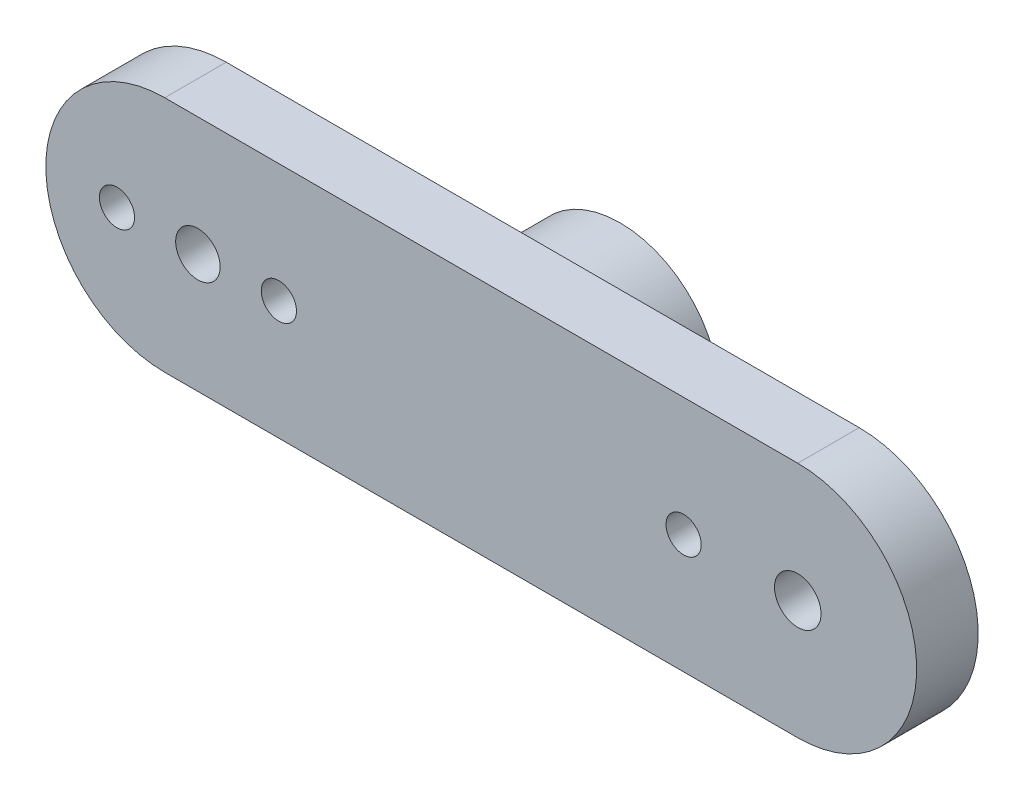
ISO-10303-21;
HEADER;
FILE_DESCRIPTION(('STEP AP214'),'2;1');
FILE_NAME('part.step','',(''),(''),'','','');
FILE_SCHEMA(('AUTOMOTIVE_DESIGN { 1 0 10303 214 1 1 1 1 }'));
ENDSEC;
DATA;
#1=APPLICATION_CONTEXT('core data for automotive mechanical design processes');
#2=APPLICATION_PROTOCOL_DEFINITION('international standard','automotive_design',2000,#1);
#3=PRODUCT_CONTEXT('',#1,'mechanical');
#4=PRODUCT('Part','Part','',(#3));
#5=PRODUCT_RELATED_PRODUCT_CATEGORY('part','',(#4));
#6=PRODUCT_DEFINITION_FORMATION('','',#4);
#7=PRODUCT_DEFINITION_CONTEXT('part definition',#1,'design');
#8=PRODUCT_DEFINITION('design','',#6,#7);
#9=PRODUCT_DEFINITION_SHAPE('','',#8);
#10=(LENGTH_UNIT() NAMED_UNIT(*) SI_UNIT(.MILLI.,.METRE.));
#11=(NAMED_UNIT(*) PLANE_ANGLE_UNIT() SI_UNIT($,.RADIAN.));
#12=(NAMED_UNIT(*) SI_UNIT($,.STERADIAN.) SOLID_ANGLE_UNIT());
#13=UNCERTAINTY_MEASURE_WITH_UNIT(LENGTH_MEASURE(1.E-05),#10,'distance_accuracy_value','');
#14=(GEOMETRIC_REPRESENTATION_CONTEXT(3) GLOBAL_UNCERTAINTY_ASSIGNED_CONTEXT((#13)) GLOBAL_UNIT_ASSIGNED_CONTEXT((#10,
#11,#12)) REPRESENTATION_CONTEXT('',''));
#15=CARTESIAN_POINT('',(0.,0.,0.));
#16=DIRECTION('',(0.,0.,1.));
#17=DIRECTION('',(1.,0.,0.));
#18=AXIS2_PLACEMENT_3D('',#15,#16,#17);
#19=CARTESIAN_POINT('',(14.9421564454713,11.0283619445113,17.7217193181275));
#20=DIRECTION('',(0.,0.,-1.));
#21=DIRECTION('',(-1.,0.,0.));
#22=AXIS2_PLACEMENT_3D('',#19,#20,#21);
#23=CYLINDRICAL_SURFACE('',#22,4.915);
#24=CARTESIAN_POINT('',(14.9421564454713,11.0283619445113,0.));
#25=DIRECTION('',(0.,0.,1.));
#26=DIRECTION('',(1.,0.,0.));
#27=AXIS2_PLACEMENT_3D('',#24,#25,#26);
#28=CIRCLE('',#27,4.915);
#29=CARTESIAN_POINT('',(19.8571564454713,11.0283619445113,0.));
#30=VERTEX_POINT('',#29);
#31=EDGE_CURVE('E35',#30,#30,#28,.T.);
#32=ORIENTED_EDGE('',*,*,#31,.T.);
#33=EDGE_LOOP('',(#32));
#34=FACE_BOUND('',#33,.T.);
#35=CARTESIAN_POINT('',(14.9421564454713,11.0283619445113,3.82));
#36=DIRECTION('',(0.,0.,1.));
#37=DIRECTION('',(1.,0.,0.));
#38=AXIS2_PLACEMENT_3D('',#35,#36,#37);
#39=CIRCLE('',#38,4.915);
#40=CARTESIAN_POINT('',(19.8571564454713,11.0283619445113,3.82));
#41=VERTEX_POINT('',#40);
#42=EDGE_CURVE('E11',#41,#41,#39,.T.);
#43=ORIENTED_EDGE('',*,*,#42,.F.);
#44=EDGE_LOOP('',(#43));
#45=FACE_BOUND('',#44,.T.);
#46=ADVANCED_FACE('F32',(#34,#45),#23,.T.);
#47=CARTESIAN_POINT('',(14.9421564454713,11.0283619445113,0.));
#48=DIRECTION('',(0.,0.,1.));
#49=DIRECTION('',(1.,0.,0.));
#50=AXIS2_PLACEMENT_3D('',#47,#48,#49);
#51=PLANE('',#50);
#52=ORIENTED_EDGE('',*,*,#31,.F.);
#53=EDGE_LOOP('',(#52));
#54=FACE_BOUND('',#53,.T.);
#55=CARTESIAN_POINT('',(14.9421564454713,11.0283619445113,0.));
#56=DIRECTION('',(0.,0.,1.));
#57=DIRECTION('',(1.,0.,0.));
#58=AXIS2_PLACEMENT_3D('',#55,#56,#57);
#59=CIRCLE('',#58,2.96);
#60=CARTESIAN_POINT('',(17.9021564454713,11.0283619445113,0.));
#61=VERTEX_POINT('',#60);
#62=EDGE_CURVE('E113',#61,#61,#59,.T.);
#63=ORIENTED_EDGE('',*,*,#62,.T.);
#64=EDGE_LOOP('',(#63));
#65=FACE_BOUND('',#64,.T.);
#66=ADVANCED_FACE('F122',(#54,#65),#51,.F.);
#67=CARTESIAN_POINT('',(14.9421564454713,11.0283619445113,17.7217193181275));
#68=DIRECTION('',(0.,0.,-1.));
#69=DIRECTION('',(-1.,0.,0.));
#70=AXIS2_PLACEMENT_3D('',#67,#68,#69);
#71=CYLINDRICAL_SURFACE('',#70,2.96);
#72=ORIENTED_EDGE('',*,*,#62,.F.);
#73=EDGE_LOOP('',(#72));
#74=FACE_BOUND('',#73,.T.);
#75=CARTESIAN_POINT('',(14.9421564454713,11.0283619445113,3.82));
#76=DIRECTION('',(0.,0.,1.));
#77=DIRECTION('',(1.,0.,0.));
#78=AXIS2_PLACEMENT_3D('',#75,#76,#77);
#79=CIRCLE('',#78,2.96);
#80=CARTESIAN_POINT('',(17.9021564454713,11.0283619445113,3.82));
#81=VERTEX_POINT('',#80);
#82=EDGE_CURVE('E111',#81,#81,#79,.T.);
#83=ORIENTED_EDGE('',*,*,#82,.T.);
#84=EDGE_LOOP('',(#83));
#85=FACE_BOUND('',#84,.T.);
#86=ADVANCED_FACE('F124',(#74,#85),#71,.F.);
#87=CARTESIAN_POINT('',(-0.697843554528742,11.0283619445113,3.82));
#88=DIRECTION('',(0.,0.,1.));
#89=DIRECTION('',(1.,0.,0.));
#90=AXIS2_PLACEMENT_3D('',#87,#88,#89);
#91=PLANE('',#90);
#92=ORIENTED_EDGE('',*,*,#82,.F.);
#93=EDGE_LOOP('',(#92));
#94=FACE_BOUND('',#93,.T.);
#95=ADVANCED_FACE('F129',(#94),#91,.F.);
#96=CARTESIAN_POINT('',(24.9421564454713,11.0283619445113,3.82));
#97=DIRECTION('',(0.,0.,1.));
#98=DIRECTION('',(-1.,0.,0.));
#99=AXIS2_PLACEMENT_3D('',#96,#97,#98);
#100=CIRCLE('',#99,0.870000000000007);
#101=CARTESIAN_POINT('',(24.0721564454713,11.0283619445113,3.82));
#102=VERTEX_POINT('',#101);
#103=EDGE_CURVE('E181',#102,#102,#100,.T.);
#104=ORIENTED_EDGE('',*,*,#103,.T.);
#105=EDGE_LOOP('',(#104));
#106=FACE_BOUND('',#105,.T.);
#107=CARTESIAN_POINT('',(0.942156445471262,11.0283619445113,3.82));
#108=DIRECTION('',(0.,0.,1.));
#109=DIRECTION('',(1.,0.,0.));
#110=AXIS2_PLACEMENT_3D('',#107,#108,#109);
#111=CIRCLE('',#110,1.1);
#112=CARTESIAN_POINT('',(2.04215644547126,11.0283619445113,3.82));
#113=VERTEX_POINT('',#112);
#114=EDGE_CURVE('E193',#113,#113,#111,.T.);
#115=ORIENTED_EDGE('',*,*,#114,.T.);
#116=EDGE_LOOP('',(#115));
#117=FACE_BOUND('',#116,.T.);
#118=CARTESIAN_POINT('',(-0.697843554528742,11.0283619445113,3.82));
#119=DIRECTION('',(0.,0.,1.));
#120=DIRECTION('',(1.,0.,0.));
#121=AXIS2_PLACEMENT_3D('',#118,#119,#120);
#122=CIRCLE('',#121,5.875);
#123=CARTESIAN_POINT('',(-0.697843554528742,16.9033619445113,3.82));
#124=VERTEX_POINT('',#123);
#125=CARTESIAN_POINT('',(-0.697843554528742,5.15336194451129,3.82));
#126=VERTEX_POINT('',#125);
#127=EDGE_CURVE('E101',#124,#126,#122,.T.);
#128=ORIENTED_EDGE('',*,*,#127,.F.);
#129=DIRECTION('',(-1.,0.,0.));
#130=VECTOR('',#129,1.);
#131=CARTESIAN_POINT('',(30.5821564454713,16.9033619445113,3.82));
#132=LINE('',#131,#130);
#133=CARTESIAN_POINT('',(30.5821564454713,16.9033619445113,3.82));
#134=VERTEX_POINT('',#133);
#135=EDGE_CURVE('E72',#134,#124,#132,.T.);
#136=ORIENTED_EDGE('',*,*,#135,.F.);
#137=CARTESIAN_POINT('',(30.5821564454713,11.0283619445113,3.82));
#138=DIRECTION('',(0.,0.,1.));
#139=DIRECTION('',(-1.,0.,0.));
#140=AXIS2_PLACEMENT_3D('',#137,#138,#139);
#141=CIRCLE('',#140,5.875);
#142=CARTESIAN_POINT('',(30.5821564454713,5.15336194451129,3.82));
#143=VERTEX_POINT('',#142);
#144=EDGE_CURVE('E66',#143,#134,#141,.T.);
#145=ORIENTED_EDGE('',*,*,#144,.F.);
#146=DIRECTION('',(1.,0.,0.));
#147=VECTOR('',#146,1.);
#148=CARTESIAN_POINT('',(30.5821564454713,5.15336194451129,3.82));
#149=LINE('',#148,#147);
#150=EDGE_CURVE('E91',#126,#143,#149,.T.);
#151=ORIENTED_EDGE('',*,*,#150,.F.);
#152=EDGE_LOOP('',(#128,#136,#145,#151));
#153=FACE_BOUND('',#152,.T.);
#154=CARTESIAN_POINT('',(4.94215644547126,11.0283619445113,3.82));
#155=DIRECTION('',(0.,0.,1.));
#156=DIRECTION('',(1.,0.,0.));
#157=AXIS2_PLACEMENT_3D('',#154,#155,#156);
#158=CIRCLE('',#157,0.87);
#159=CARTESIAN_POINT('',(5.81215644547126,11.0283619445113,3.82));
#160=VERTEX_POINT('',#159);
#161=EDGE_CURVE('E199',#160,#160,#158,.T.);
#162=ORIENTED_EDGE('',*,*,#161,.T.);
#163=EDGE_LOOP('',(#162));
#164=FACE_BOUND('',#163,.T.);
#165=CARTESIAN_POINT('',(-3.05784355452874,11.0283619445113,3.82));
#166=DIRECTION('',(0.,0.,1.));
#167=DIRECTION('',(1.,0.,0.));
#168=AXIS2_PLACEMENT_3D('',#165,#166,#167);
#169=CIRCLE('',#168,0.869999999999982);
#170=CARTESIAN_POINT('',(-2.18784355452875,11.0283619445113,3.82));
#171=VERTEX_POINT('',#170);
#172=EDGE_CURVE('E187',#171,#171,#169,.T.);
#173=ORIENTED_EDGE('',*,*,#172,.T.);
#174=EDGE_LOOP('',(#173));
#175=FACE_BOUND('',#174,.T.);
#176=CARTESIAN_POINT('',(30.5821564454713,11.0283619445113,3.82));
#177=DIRECTION('',(0.,0.,1.));
#178=DIRECTION('',(1.,0.,0.));
#179=AXIS2_PLACEMENT_3D('',#176,#177,#178);
#180=CIRCLE('',#179,1.15);
#181=CARTESIAN_POINT('',(31.7321564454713,11.0283619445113,3.82));
#182=VERTEX_POINT('',#181);
#183=EDGE_CURVE('E178',#182,#182,#180,.T.);
#184=ORIENTED_EDGE('',*,*,#183,.T.);
#185=EDGE_LOOP('',(#184));
#186=FACE_BOUND('',#185,.T.);
#187=ORIENTED_EDGE('',*,*,#42,.T.);
#188=EDGE_LOOP('',(#187));
#189=FACE_BOUND('',#188,.T.);
#190=ADVANCED_FACE('F147',(#106,#117,#153,#164,#175,#186,#189),#91,.F.);
#191=CARTESIAN_POINT('',(-0.697843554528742,11.0283619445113,6.86));
#192=DIRECTION('',(0.,0.,1.));
#193=DIRECTION('',(1.,0.,0.));
#194=AXIS2_PLACEMENT_3D('',#191,#192,#193);
#195=PLANE('',#194);
#196=CARTESIAN_POINT('',(24.9421564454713,11.0283619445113,6.86));
#197=DIRECTION('',(0.,0.,1.));
#198=DIRECTION('',(-1.,0.,0.));
#199=AXIS2_PLACEMENT_3D('',#196,#197,#198);
#200=CIRCLE('',#199,0.870000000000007);
#201=CARTESIAN_POINT('',(24.0721564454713,11.0283619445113,6.86));
#202=VERTEX_POINT('',#201);
#203=EDGE_CURVE('E184',#202,#202,#200,.T.);
#204=ORIENTED_EDGE('',*,*,#203,.F.);
#205=EDGE_LOOP('',(#204));
#206=FACE_BOUND('',#205,.T.);
#207=CARTESIAN_POINT('',(0.942156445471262,11.0283619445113,6.86));
#208=DIRECTION('',(0.,0.,1.));
#209=DIRECTION('',(1.,0.,0.));
#210=AXIS2_PLACEMENT_3D('',#207,#208,#209);
#211=CIRCLE('',#210,1.1);
#212=CARTESIAN_POINT('',(2.04215644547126,11.0283619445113,6.86));
#213=VERTEX_POINT('',#212);
#214=EDGE_CURVE('E196',#213,#213,#211,.T.);
#215=ORIENTED_EDGE('',*,*,#214,.F.);
#216=EDGE_LOOP('',(#215));
#217=FACE_BOUND('',#216,.T.);
#218=CARTESIAN_POINT('',(-0.697843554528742,11.0283619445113,6.86));
#219=DIRECTION('',(0.,0.,1.));
#220=DIRECTION('',(1.,0.,0.));
#221=AXIS2_PLACEMENT_3D('',#218,#219,#220);
#222=CIRCLE('',#221,5.875);
#223=CARTESIAN_POINT('',(-0.697843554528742,16.9033619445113,6.86));
#224=VERTEX_POINT('',#223);
#225=CARTESIAN_POINT('',(-0.697843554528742,5.15336194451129,6.86));
#226=VERTEX_POINT('',#225);
#227=EDGE_CURVE('E86',#224,#226,#222,.T.);
#228=ORIENTED_EDGE('',*,*,#227,.T.);
#229=DIRECTION('',(1.,0.,0.));
#230=VECTOR('',#229,1.);
#231=CARTESIAN_POINT('',(30.5821564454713,5.15336194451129,6.86));
#232=LINE('',#231,#230);
#233=CARTESIAN_POINT('',(30.5821564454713,5.15336194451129,6.86));
#234=VERTEX_POINT('',#233);
#235=EDGE_CURVE('E80',#226,#234,#232,.T.);
#236=ORIENTED_EDGE('',*,*,#235,.T.);
#237=CARTESIAN_POINT('',(30.5821564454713,11.0283619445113,6.86));
#238=DIRECTION('',(0.,0.,1.));
#239=DIRECTION('',(-1.,0.,0.));
#240=AXIS2_PLACEMENT_3D('',#237,#238,#239);
#241=CIRCLE('',#240,5.875);
#242=CARTESIAN_POINT('',(30.5821564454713,16.9033619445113,6.86));
#243=VERTEX_POINT('',#242);
#244=EDGE_CURVE('E84',#234,#243,#241,.T.);
#245=ORIENTED_EDGE('',*,*,#244,.T.);
#246=DIRECTION('',(-1.,0.,0.));
#247=VECTOR('',#246,1.);
#248=CARTESIAN_POINT('',(30.5821564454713,16.9033619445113,6.86));
#249=LINE('',#248,#247);
#250=EDGE_CURVE('E49',#243,#224,#249,.T.);
#251=ORIENTED_EDGE('',*,*,#250,.T.);
#252=EDGE_LOOP('',(#228,#236,#245,#251));
#253=FACE_BOUND('',#252,.T.);
#254=CARTESIAN_POINT('',(4.94215644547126,11.0283619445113,6.86));
#255=DIRECTION('',(0.,0.,1.));
#256=DIRECTION('',(1.,0.,0.));
#257=AXIS2_PLACEMENT_3D('',#254,#255,#256);
#258=CIRCLE('',#257,0.87);
#259=CARTESIAN_POINT('',(5.81215644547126,11.0283619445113,6.86));
#260=VERTEX_POINT('',#259);
#261=EDGE_CURVE('E104',#260,#260,#258,.T.);
#262=ORIENTED_EDGE('',*,*,#261,.F.);
#263=EDGE_LOOP('',(#262));
#264=FACE_BOUND('',#263,.T.);
#265=CARTESIAN_POINT('',(-3.05784355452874,11.0283619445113,6.86));
#266=DIRECTION('',(0.,0.,1.));
#267=DIRECTION('',(1.,0.,0.));
#268=AXIS2_PLACEMENT_3D('',#265,#266,#267);
#269=CIRCLE('',#268,0.869999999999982);
#270=CARTESIAN_POINT('',(-2.18784355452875,11.0283619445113,6.86));
#271=VERTEX_POINT('',#270);
#272=EDGE_CURVE('E190',#271,#271,#269,.T.);
#273=ORIENTED_EDGE('',*,*,#272,.F.);
#274=EDGE_LOOP('',(#273));
#275=FACE_BOUND('',#274,.T.);
#276=CARTESIAN_POINT('',(30.5821564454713,11.0283619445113,6.86));
#277=DIRECTION('',(0.,0.,1.));
#278=DIRECTION('',(1.,0.,0.));
#279=AXIS2_PLACEMENT_3D('',#276,#277,#278);
#280=CIRCLE('',#279,1.15);
#281=CARTESIAN_POINT('',(31.7321564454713,11.0283619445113,6.86));
#282=VERTEX_POINT('',#281);
#283=EDGE_CURVE('E175',#282,#282,#280,.T.);
#284=ORIENTED_EDGE('',*,*,#283,.F.);
#285=EDGE_LOOP('',(#284));
#286=FACE_BOUND('',#285,.T.);
#287=ADVANCED_FACE('F81',(#206,#217,#253,#264,#275,#286),#195,.T.);
#288=CARTESIAN_POINT('',(-0.697843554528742,11.0283619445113,6.86));
#289=DIRECTION('',(0.,0.,-1.));
#290=DIRECTION('',(-1.,0.,0.));
#291=AXIS2_PLACEMENT_3D('',#288,#289,#290);
#292=CYLINDRICAL_SURFACE('',#291,5.875);
#293=ORIENTED_EDGE('',*,*,#127,.T.);
#294=DIRECTION('',(0.,0.,-1.));
#295=VECTOR('',#294,1.);
#296=CARTESIAN_POINT('',(-0.697843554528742,5.15336194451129,6.86));
#297=LINE('',#296,#295);
#298=EDGE_CURVE('E92',#226,#126,#297,.T.);
#299=ORIENTED_EDGE('',*,*,#298,.F.);
#300=ORIENTED_EDGE('',*,*,#227,.F.);
#301=DIRECTION('',(0.,0.,-1.));
#302=VECTOR('',#301,1.);
#303=CARTESIAN_POINT('',(-0.697843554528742,16.9033619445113,6.86));
#304=LINE('',#303,#302);
#305=EDGE_CURVE('E97',#224,#124,#304,.T.);
#306=ORIENTED_EDGE('',*,*,#305,.T.);
#307=EDGE_LOOP('',(#293,#299,#300,#306));
#308=FACE_BOUND('',#307,.T.);
#309=ADVANCED_FACE('F133',(#308),#292,.T.);
#310=CARTESIAN_POINT('',(30.5821564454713,5.15336194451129,6.86));
#311=DIRECTION('',(0.,1.,0.));
#312=DIRECTION('',(-1.,0.,0.));
#313=AXIS2_PLACEMENT_3D('',#310,#311,#312);
#314=PLANE('',#313);
#315=ORIENTED_EDGE('',*,*,#150,.T.);
#316=DIRECTION('',(0.,0.,-1.));
#317=VECTOR('',#316,1.);
#318=CARTESIAN_POINT('',(30.5821564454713,5.15336194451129,6.86));
#319=LINE('',#318,#317);
#320=EDGE_CURVE('E89',#234,#143,#319,.T.);
#321=ORIENTED_EDGE('',*,*,#320,.F.);
#322=ORIENTED_EDGE('',*,*,#235,.F.);
#323=ORIENTED_EDGE('',*,*,#298,.T.);
#324=EDGE_LOOP('',(#315,#321,#322,#323));
#325=FACE_BOUND('',#324,.T.);
#326=ADVANCED_FACE('F90',(#325),#314,.F.);
#327=CARTESIAN_POINT('',(30.5821564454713,11.0283619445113,6.86));
#328=DIRECTION('',(0.,0.,-1.));
#329=DIRECTION('',(-1.,0.,0.));
#330=AXIS2_PLACEMENT_3D('',#327,#328,#329);
#331=CYLINDRICAL_SURFACE('',#330,5.875);
#332=ORIENTED_EDGE('',*,*,#144,.T.);
#333=DIRECTION('',(0.,0.,-1.));
#334=VECTOR('',#333,1.);
#335=CARTESIAN_POINT('',(30.5821564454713,16.9033619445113,6.86));
#336=LINE('',#335,#334);
#337=EDGE_CURVE('E93',#243,#134,#336,.T.);
#338=ORIENTED_EDGE('',*,*,#337,.F.);
#339=ORIENTED_EDGE('',*,*,#244,.F.);
#340=ORIENTED_EDGE('',*,*,#320,.T.);
#341=EDGE_LOOP('',(#332,#338,#339,#340));
#342=FACE_BOUND('',#341,.T.);
#343=ADVANCED_FACE('F95',(#342),#331,.T.);
#344=CARTESIAN_POINT('',(30.5821564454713,16.9033619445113,6.86));
#345=DIRECTION('',(0.,-1.,0.));
#346=DIRECTION('',(1.,0.,0.));
#347=AXIS2_PLACEMENT_3D('',#344,#345,#346);
#348=PLANE('',#347);
#349=ORIENTED_EDGE('',*,*,#135,.T.);
#350=ORIENTED_EDGE('',*,*,#305,.F.);
#351=ORIENTED_EDGE('',*,*,#250,.F.);
#352=ORIENTED_EDGE('',*,*,#337,.T.);
#353=EDGE_LOOP('',(#349,#350,#351,#352));
#354=FACE_BOUND('',#353,.T.);
#355=ADVANCED_FACE('F141',(#354),#348,.F.);
#356=CARTESIAN_POINT('',(4.94215644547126,11.0283619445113,6.86));
#357=DIRECTION('',(0.,0.,-1.));
#358=DIRECTION('',(-1.,0.,0.));
#359=AXIS2_PLACEMENT_3D('',#356,#357,#358);
#360=CYLINDRICAL_SURFACE('',#359,0.87);
#361=ORIENTED_EDGE('',*,*,#261,.T.);
#362=EDGE_LOOP('',(#361));
#363=FACE_BOUND('',#362,.T.);
#364=ORIENTED_EDGE('',*,*,#161,.F.);
#365=EDGE_LOOP('',(#364));
#366=FACE_BOUND('',#365,.T.);
#367=ADVANCED_FACE('F144',(#363,#366),#360,.F.);
#368=CARTESIAN_POINT('',(0.942156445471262,11.0283619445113,6.86));
#369=DIRECTION('',(0.,0.,-1.));
#370=DIRECTION('',(-1.,0.,0.));
#371=AXIS2_PLACEMENT_3D('',#368,#369,#370);
#372=CYLINDRICAL_SURFACE('',#371,1.1);
#373=ORIENTED_EDGE('',*,*,#214,.T.);
#374=EDGE_LOOP('',(#373));
#375=FACE_BOUND('',#374,.T.);
#376=ORIENTED_EDGE('',*,*,#114,.F.);
#377=EDGE_LOOP('',(#376));
#378=FACE_BOUND('',#377,.T.);
#379=ADVANCED_FACE('F154',(#375,#378),#372,.F.);
#380=CARTESIAN_POINT('',(-3.05784355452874,11.0283619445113,6.86));
#381=DIRECTION('',(0.,0.,-1.));
#382=DIRECTION('',(-1.,0.,0.));
#383=AXIS2_PLACEMENT_3D('',#380,#381,#382);
#384=CYLINDRICAL_SURFACE('',#383,0.869999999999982);
#385=ORIENTED_EDGE('',*,*,#272,.T.);
#386=EDGE_LOOP('',(#385));
#387=FACE_BOUND('',#386,.T.);
#388=ORIENTED_EDGE('',*,*,#172,.F.);
#389=EDGE_LOOP('',(#388));
#390=FACE_BOUND('',#389,.T.);
#391=ADVANCED_FACE('F158',(#387,#390),#384,.F.);
#392=CARTESIAN_POINT('',(24.9421564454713,11.0283619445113,6.86));
#393=DIRECTION('',(0.,0.,-1.));
#394=DIRECTION('',(-1.,0.,0.));
#395=AXIS2_PLACEMENT_3D('',#392,#393,#394);
#396=CYLINDRICAL_SURFACE('',#395,0.870000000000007);
#397=ORIENTED_EDGE('',*,*,#203,.T.);
#398=EDGE_LOOP('',(#397));
#399=FACE_BOUND('',#398,.T.);
#400=ORIENTED_EDGE('',*,*,#103,.F.);
#401=EDGE_LOOP('',(#400));
#402=FACE_BOUND('',#401,.T.);
#403=ADVANCED_FACE('F162',(#399,#402),#396,.F.);
#404=CARTESIAN_POINT('',(30.5821564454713,11.0283619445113,6.86));
#405=DIRECTION('',(0.,0.,-1.));
#406=DIRECTION('',(-1.,0.,0.));
#407=AXIS2_PLACEMENT_3D('',#404,#405,#406);
#408=CYLINDRICAL_SURFACE('',#407,1.15);
#409=ORIENTED_EDGE('',*,*,#283,.T.);
#410=EDGE_LOOP('',(#409));
#411=FACE_BOUND('',#410,.T.);
#412=ORIENTED_EDGE('',*,*,#183,.F.);
#413=EDGE_LOOP('',(#412));
#414=FACE_BOUND('',#413,.T.);
#415=ADVANCED_FACE('F166',(#411,#414),#408,.F.);
#416=CLOSED_SHELL('',(#46,#66,#86,#95,#190,#287,#309,#326,#343,#355,#367,#379,#391,#403,#415));
#417=MANIFOLD_SOLID_BREP('B2',#416);
#418=ADVANCED_BREP_SHAPE_REPRESENTATION('',(#18,#417),#14);
#419=SHAPE_DEFINITION_REPRESENTATION(#9,#418);
ENDSEC;
END-ISO-10303-21;
